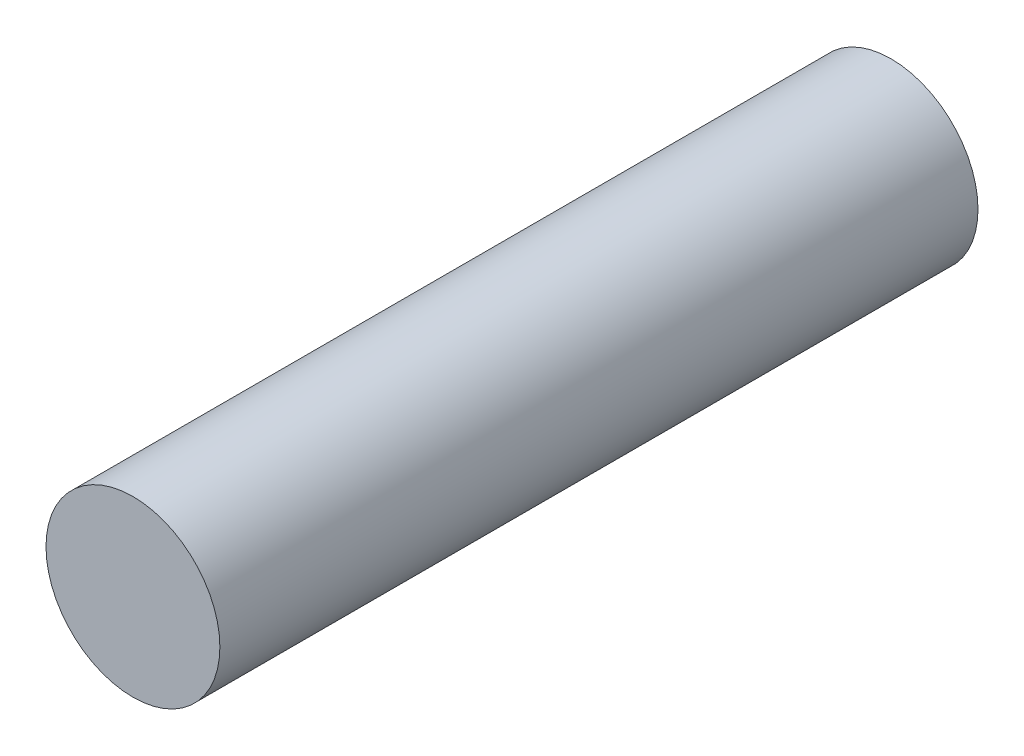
from build123d import *

# Parameters (mm, degrees)
SKETCH1_R           = 3.175
BOSS_EXTRUDE1_DEPTH = 27.686


with BuildPart() as part:
    # Sketch1 → Boss-Extrude1 (new body)
    with BuildSketch(Plane.XY):
        Circle(SKETCH1_R)
    extrude(amount=BOSS_EXTRUDE1_DEPTH)


solid = part.part
